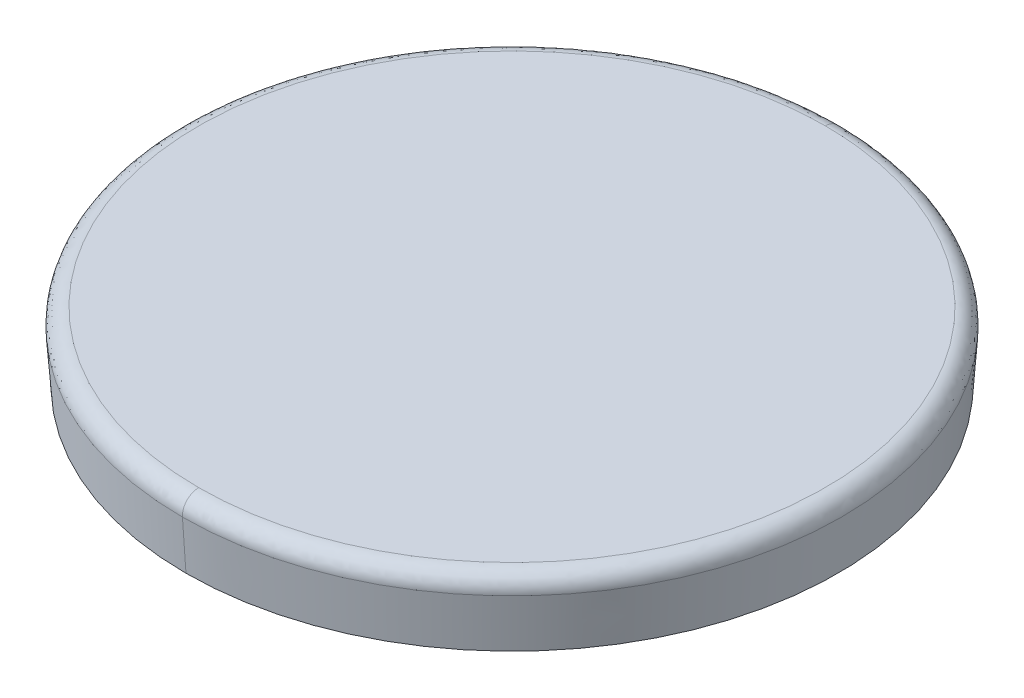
ISO-10303-21;
HEADER;
FILE_DESCRIPTION(('STEP AP214'),'2;1');
FILE_NAME('part.step','',(''),(''),'','','');
FILE_SCHEMA(('AUTOMOTIVE_DESIGN { 1 0 10303 214 1 1 1 1 }'));
ENDSEC;
DATA;
#1=APPLICATION_CONTEXT('core data for automotive mechanical design processes');
#2=APPLICATION_PROTOCOL_DEFINITION('international standard','automotive_design',2000,#1);
#3=PRODUCT_CONTEXT('',#1,'mechanical');
#4=PRODUCT('Part','Part','',(#3));
#5=PRODUCT_RELATED_PRODUCT_CATEGORY('part','',(#4));
#6=PRODUCT_DEFINITION_FORMATION('','',#4);
#7=PRODUCT_DEFINITION_CONTEXT('part definition',#1,'design');
#8=PRODUCT_DEFINITION('design','',#6,#7);
#9=PRODUCT_DEFINITION_SHAPE('','',#8);
#10=(LENGTH_UNIT() NAMED_UNIT(*) SI_UNIT(.MILLI.,.METRE.));
#11=(NAMED_UNIT(*) PLANE_ANGLE_UNIT() SI_UNIT($,.RADIAN.));
#12=(NAMED_UNIT(*) SI_UNIT($,.STERADIAN.) SOLID_ANGLE_UNIT());
#13=UNCERTAINTY_MEASURE_WITH_UNIT(LENGTH_MEASURE(1.E-05),#10,'distance_accuracy_value','');
#14=(GEOMETRIC_REPRESENTATION_CONTEXT(3) GLOBAL_UNCERTAINTY_ASSIGNED_CONTEXT((#13)) GLOBAL_UNIT_ASSIGNED_CONTEXT((#10,
#11,#12)) REPRESENTATION_CONTEXT('',''));
#15=CARTESIAN_POINT('',(0.,0.,0.));
#16=DIRECTION('',(0.,0.,1.));
#17=DIRECTION('',(1.,0.,0.));
#18=AXIS2_PLACEMENT_3D('',#15,#16,#17);
#19=CARTESIAN_POINT('',(32.,13.2498463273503,7.06539894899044));
#20=CARTESIAN_POINT('',(43.5307978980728,13.2498463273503,7.06539894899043));
#21=CARTESIAN_POINT('',(43.5307978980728,13.2498463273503,-4.46539894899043));
#22=CARTESIAN_POINT('',(32.,13.2498463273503,-4.46539894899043));
#23=CARTESIAN_POINT('',(32.,13.2560836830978,7.26019516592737));
#24=CARTESIAN_POINT('',(43.9203903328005,13.2560836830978,7.26019516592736));
#25=CARTESIAN_POINT('',(43.9203903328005,13.2560836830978,-4.66019516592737));
#26=CARTESIAN_POINT('',(32.,13.2560836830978,-4.66019516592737));
#27=CARTESIAN_POINT('',(32.,13.113584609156,7.39317039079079));
#28=CARTESIAN_POINT('',(44.1863407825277,13.113584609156,7.3931703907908));
#29=CARTESIAN_POINT('',(44.1863407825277,13.113584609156,-4.79317039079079));
#30=CARTESIAN_POINT('',(32.,13.113584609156,-4.79317039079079));
#31=CARTESIAN_POINT('',(32.,12.91966729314,7.37346260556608));
#32=CARTESIAN_POINT('',(44.1469252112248,12.9196672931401,7.3734626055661));
#33=CARTESIAN_POINT('',(44.1469252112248,12.9196672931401,-4.77346260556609));
#34=CARTESIAN_POINT('',(32.,12.91966729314,-4.77346260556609));
#35=(BOUNDED_SURFACE() B_SPLINE_SURFACE(3,3,((#19,#20,#21,#22),(#23,#24,#25,#26),(#27,#28,#29,
#30),(#31,#32,#33,#34)),.UNSPECIFIED.,.F.,.F.,.F.) B_SPLINE_SURFACE_WITH_KNOTS((4,4),(4,4),
(0.0420276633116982,0.957651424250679),(0.,1.),
.UNSPECIFIED.) GEOMETRIC_REPRESENTATION_ITEM() RATIONAL_B_SPLINE_SURFACE(((0.968240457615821,
0.322746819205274,0.322746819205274,0.968240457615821),(0.747718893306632,0.249239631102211,
0.249239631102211,0.747718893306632),(0.74764163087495,0.249213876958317,0.249213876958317,
0.74764163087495),(0.968008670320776,0.322669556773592,0.322669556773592,0.968008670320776))) REPRESENTATION_ITEM('') SURFACE());
#36=CARTESIAN_POINT('',(32.,12.9290767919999,1.3));
#37=DIRECTION('',(0.,1.,0.));
#38=DIRECTION('',(0.,0.,1.));
#39=AXIS2_PLACEMENT_3D('',#36,#37,#38);
#40=CIRCLE('',#39,6.074269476);
#41=CARTESIAN_POINT('',(32.,12.9290767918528,7.37426947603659));
#42=VERTEX_POINT('',#41);
#43=CARTESIAN_POINT('',(31.9999999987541,12.9290767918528,-4.77426947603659));
#44=VERTEX_POINT('',#43);
#45=EDGE_CURVE('E82',#42,#44,#40,.T.);
#46=CARTESIAN_POINT('',(31.9999999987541,12.9290767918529,-4.77426947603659));
#47=CARTESIAN_POINT('',(32.,13.1142460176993,-4.78721544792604));
#48=CARTESIAN_POINT('',(32.,13.2499999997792,-4.6606212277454));
#49=CARTESIAN_POINT('',(32.,13.2500000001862,-4.47499999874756));
#50=(BOUNDED_CURVE() B_SPLINE_CURVE(3,(#46,#47,#48,#49),.UNSPECIFIED.,.F.,
.F.) B_SPLINE_CURVE_WITH_KNOTS((4,4),(0.061361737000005,0.938638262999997),
.UNSPECIFIED.) CURVE() GEOMETRIC_REPRESENTATION_ITEM() RATIONAL_B_SPLINE_CURVE((0.954565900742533,
0.752199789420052,0.752199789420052,0.954565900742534)) REPRESENTATION_ITEM(''));
#51=CARTESIAN_POINT('',(32.,13.2500000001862,-4.47499999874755));
#52=VERTEX_POINT('',#51);
#53=EDGE_CURVE('E103',#44,#52,#50,.T.);
#54=CARTESIAN_POINT('',(32.,13.2500000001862,7.07499999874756));
#55=CARTESIAN_POINT('',(32.1282479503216,13.25,7.07499999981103));
#56=CARTESIAN_POINT('',(32.320258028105,13.25,7.06861172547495));
#57=CARTESIAN_POINT('',(32.5436365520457,13.25,7.0499792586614));
#58=CARTESIAN_POINT('',(32.6551675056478,13.25,7.0378681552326));
#59=CARTESIAN_POINT('',(32.7029325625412,13.25,7.03207878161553));
#60=CARTESIAN_POINT('',(32.7347683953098,13.25,7.02808611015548));
#61=CARTESIAN_POINT('',(32.7486141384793,13.25,7.02630006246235));
#62=CARTESIAN_POINT('',(32.9104231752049,13.25,7.00464374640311));
#63=CARTESIAN_POINT('',(33.1245967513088,13.25,6.96771947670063));
#64=CARTESIAN_POINT('',(33.3717152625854,13.25,6.91055509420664));
#65=CARTESIAN_POINT('',(33.4945868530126,13.25,6.87845138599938));
#66=CARTESIAN_POINT('',(33.5558507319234,13.25,6.86151915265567));
#67=CARTESIAN_POINT('',(33.5820698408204,13.25,6.85407382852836));
#68=CARTESIAN_POINT('',(33.599541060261,13.25,6.84906835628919));
#69=CARTESIAN_POINT('',(33.607180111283,13.25,6.84686318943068));
#70=CARTESIAN_POINT('',(33.7741182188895,13.25,6.79818896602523));
#71=CARTESIAN_POINT('',(34.0061591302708,13.25,6.71970709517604));
#72=CARTESIAN_POINT('',(34.2705097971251,13.25,6.61105560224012));
#73=CARTESIAN_POINT('',(34.4010941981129,13.25,6.55245752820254));
#74=CARTESIAN_POINT('',(34.465988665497,13.25,6.52209040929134));
#75=CARTESIAN_POINT('',(34.4937153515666,13.25,6.50884705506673));
#76=CARTESIAN_POINT('',(34.5121808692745,13.25,6.49996729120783));
#77=CARTESIAN_POINT('',(34.520327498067,13.25,6.49602673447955));
#78=CARTESIAN_POINT('',(34.6952656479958,13.25,6.4107632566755));
#79=CARTESIAN_POINT('',(34.9355491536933,13.25,6.27920086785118));
#80=CARTESIAN_POINT('',(35.2041759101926,13.25,6.1061281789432));
#81=CARTESIAN_POINT('',(35.3355632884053,13.25,6.01469602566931));
#82=CARTESIAN_POINT('',(35.4005254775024,13.25,5.96775599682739));
#83=CARTESIAN_POINT('',(35.4282096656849,13.25,5.94737656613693));
#84=CARTESIAN_POINT('',(35.4466309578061,13.25,5.93373199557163));
#85=CARTESIAN_POINT('',(35.4548764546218,13.25,5.92759123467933));
#86=CARTESIAN_POINT('',(35.6269767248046,13.25,5.79854024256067));
#87=CARTESIAN_POINT('',(35.8592126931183,13.25,5.6046029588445));
#88=CARTESIAN_POINT('',(36.1113786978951,13.25,5.35778441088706));
#89=CARTESIAN_POINT('',(36.2327677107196,13.25,5.22923554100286));
#90=CARTESIAN_POINT('',(36.2837857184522,13.25,5.1730418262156));
#91=CARTESIAN_POINT('',(36.3175742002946,13.25,5.1353346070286));
#92=CARTESIAN_POINT('',(36.3329576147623,13.25,5.11796142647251));
#93=CARTESIAN_POINT('',(36.4955856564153,13.25,4.93165105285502));
#94=CARTESIAN_POINT('',(36.697074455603,13.25,4.67249248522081));
#95=CARTESIAN_POINT('',(36.9052846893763,13.25,4.35133753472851));
#96=CARTESIAN_POINT('',(37.0026747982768,13.25,4.18605923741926));
#97=CARTESIAN_POINT('',(37.0429744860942,13.25,4.11421836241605));
#98=CARTESIAN_POINT('',(37.069521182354,13.25,4.06610059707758));
#99=CARTESIAN_POINT('',(37.0818708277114,13.25,4.04336164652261));
#100=CARTESIAN_POINT('',(37.2053274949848,13.25,3.81193035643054));
#101=CARTESIAN_POINT('',(37.350346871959,13.25,3.49562925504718));
#102=CARTESIAN_POINT('',(37.4852544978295,13.25,3.11309071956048));
#103=CARTESIAN_POINT('',(37.5357259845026,13.25,2.94624836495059));
#104=CARTESIAN_POINT('',(37.5677411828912,13.25,2.83437629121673));
#105=CARTESIAN_POINT('',(37.5825057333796,13.25,2.77979827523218));
#106=CARTESIAN_POINT('',(37.7157233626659,13.25,2.25545995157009));
#107=CARTESIAN_POINT('',(37.7749542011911,13.25,1.78088619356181));
#108=CARTESIAN_POINT('',(37.7750228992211,13.25,1.05955690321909));
#109=CARTESIAN_POINT('',(37.7528285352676,13.25,0.701532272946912));
#110=CARTESIAN_POINT('',(37.68803486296,13.25,0.288456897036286));
#111=CARTESIAN_POINT('',(37.6519303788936,13.25,0.112414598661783));
#112=CARTESIAN_POINT('',(37.6260083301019,13.25,-0.00472693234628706));
#113=CARTESIAN_POINT('',(37.6116505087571,13.25,-0.0650414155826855));
#114=CARTESIAN_POINT('',(37.5399364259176,13.25,-0.347526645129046));
#115=CARTESIAN_POINT('',(37.4341930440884,13.25,-0.679031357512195));
#116=CARTESIAN_POINT('',(37.27637442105,13.25,-1.05270111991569));
#117=CARTESIAN_POINT('',(37.1888522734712,13.25,-1.23626456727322));
#118=CARTESIAN_POINT('',(37.1494971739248,13.25,-1.31423359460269));
#119=CARTESIAN_POINT('',(37.1228503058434,13.25,-1.36605716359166));
#120=CARTESIAN_POINT('',(37.1085170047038,13.25,-1.39340038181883));
#121=CARTESIAN_POINT('',(36.9921580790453,13.25,-1.61162047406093));
#122=CARTESIAN_POINT('',(36.8215153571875,13.25,-1.89205218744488));
#123=CARTESIAN_POINT('',(36.595311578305,13.25,-2.2007978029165));
#124=CARTESIAN_POINT('',(36.4754295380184,13.25,-2.3505644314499));
#125=CARTESIAN_POINT('',(36.4225986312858,13.25,-2.41376309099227));
#126=CARTESIAN_POINT('',(36.3870551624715,13.25,-2.4556761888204));
#127=CARTESIAN_POINT('',(36.3676659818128,13.25,-2.47819172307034));
#128=CARTESIAN_POINT('',(36.2179187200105,13.25,-2.6498086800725));
#129=CARTESIAN_POINT('',(36.0073337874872,13.25,-2.86706245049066));
#130=CARTESIAN_POINT('',(35.7425380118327,13.25,-3.10027971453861));
#131=CARTESIAN_POINT('',(35.6053617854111,13.25,-3.21182697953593));
#132=CARTESIAN_POINT('',(35.5355790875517,13.25,-3.26633527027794));
#133=CARTESIAN_POINT('',(35.5054162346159,13.25,-3.28942482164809));
#134=CARTESIAN_POINT('',(35.4852507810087,13.25,-3.30475760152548));
#135=CARTESIAN_POINT('',(35.4741575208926,13.25,-3.3131305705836));
#136=CARTESIAN_POINT('',(35.31847966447,13.25,-3.42991086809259));
#137=CARTESIAN_POINT('',(35.0917916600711,13.25,-3.58372042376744));
#138=CARTESIAN_POINT('',(34.815234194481,13.25,-3.74381559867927));
#139=CARTESIAN_POINT('',(34.6739334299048,13.25,-3.81902585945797));
#140=CARTESIAN_POINT('',(34.6025275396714,13.25,-3.85542165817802));
#141=CARTESIAN_POINT('',(34.5717631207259,13.25,-3.87076071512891));
#142=CARTESIAN_POINT('',(34.5512175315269,13.25,-3.88092916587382));
#143=CARTESIAN_POINT('',(34.5398119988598,13.25,-3.88652815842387));
#144=CARTESIAN_POINT('',(34.38351363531,13.25,-3.96274047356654));
#145=CARTESIAN_POINT('',(34.1589831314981,13.25,-4.06066099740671));
#146=CARTESIAN_POINT('',(33.8902513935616,13.25,-4.15797327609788));
#147=CARTESIAN_POINT('',(33.7541906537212,13.25,-4.20239733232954));
#148=CARTESIAN_POINT('',(33.6857365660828,13.25,-4.2235513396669));
#149=CARTESIAN_POINT('',(33.6563083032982,13.25,-4.23239062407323));
#150=CARTESIAN_POINT('',(33.6366692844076,13.25,-4.23823309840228));
#151=CARTESIAN_POINT('',(33.6257065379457,13.25,-4.24145975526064));
#152=CARTESIAN_POINT('',(33.4776953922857,13.25,-4.28464391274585));
#153=CARTESIAN_POINT('',(33.2669160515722,13.25,-4.33761357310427));
#154=CARTESIAN_POINT('',(33.0178175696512,13.25,-4.38541814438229));
#155=CARTESIAN_POINT('',(32.8924710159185,13.25,-4.4058220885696));
#156=CARTESIAN_POINT('',(32.8385802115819,13.25,-4.41381699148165));
#157=CARTESIAN_POINT('',(32.8026150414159,13.25,-4.41898033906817));
#158=CARTESIAN_POINT('',(32.782481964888,13.25,-4.42176438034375));
#159=CARTESIAN_POINT('',(32.5123682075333,13.25,-4.4579646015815));
#160=CARTESIAN_POINT('',(32.2568372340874,13.25,-4.47499999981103));
#161=CARTESIAN_POINT('',(32.,13.2500000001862,-4.47499999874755));
#162=(BOUNDED_CURVE() B_SPLINE_CURVE(3,(#54,#55,#56,#57,#58,#59,#60,#61,#62,#63,#64,#65,#66,#67,
#68,#69,#70,#71,#72,#73,#74,#75,#76,#77,#78,#79,#80,#81,#82,#83,#84,#85,#86,#87,#88,#89,#90,#91,
#92,#93,#94,#95,#96,#97,#98,#99,#100,#101,#102,#103,#104,#105,#106,#107,#108,#109,#110,#111,
#112,#113,#114,#115,#116,#117,#118,#119,#120,#121,#122,#123,#124,#125,#126,#127,#128,#129,#130,
#131,#132,#133,#134,#135,#136,#137,#138,#139,#140,#141,#142,#143,#144,#145,#146,#147,#148,#149,
#150,#151,#152,#153,#154,#155,#156,#157,#158,#159,#160,#161),.UNSPECIFIED.,.F.,
.F.) B_SPLINE_CURVE_WITH_KNOTS((4,1,1,1,2,2,1,1,1,1,2,2,1,1,1,1,2,2,1,1,1,1,2,2,1,1,1,2,2,1,1,1,
2,2,1,1,2,2,2,1,1,2,2,1,1,1,2,2,1,1,1,2,2,1,1,1,1,2,2,1,1,1,1,2,2,1,1,1,1,2,2,1,1,1,2,2,4),(0.,
0.0312500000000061,0.0468750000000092,0.0546875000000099,0.0585937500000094,0.0625000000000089,
0.0937500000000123,0.109375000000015,0.117187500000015,0.121093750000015,0.123046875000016,
0.125000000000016,0.156250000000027,0.171875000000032,0.179687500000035,0.183593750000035,
0.185546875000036,0.187500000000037,0.218750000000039,0.23437500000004,0.24218750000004,
0.24609375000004,0.24804687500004,0.250000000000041,0.281250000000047,0.296875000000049,
0.304687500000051,0.308593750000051,0.312500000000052,0.343750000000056,0.359375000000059,
0.36718750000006,0.371093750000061,0.375000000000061,0.406250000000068,0.421875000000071,
0.429687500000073,0.437500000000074,0.5,0.531250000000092,0.546875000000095,0.554687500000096,
0.562500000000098,0.593750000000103,0.609375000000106,0.617187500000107,0.621093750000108,
0.625000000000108,0.656250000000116,0.671875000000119,0.679687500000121,0.683593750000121,
0.687500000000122,0.718750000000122,0.734375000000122,0.742187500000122,0.746093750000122,
0.748046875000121,0.750000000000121,0.781250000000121,0.79687500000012,0.80468750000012,
0.808593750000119,0.810546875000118,0.812500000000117,0.843750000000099,0.859375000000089,
0.867187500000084,0.871093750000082,0.873046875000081,0.87500000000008,0.906250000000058,
0.921875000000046,0.929687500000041,0.933593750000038,0.937500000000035,1.),
.UNSPECIFIED.) CURVE() GEOMETRIC_REPRESENTATION_ITEM() RATIONAL_B_SPLINE_CURVE((1.,1.,1.,1.,1.,
1.,1.,1.,1.,1.,1.,1.,1.,1.,1.,1.,1.,1.,1.,1.,1.,1.,1.,1.,1.,1.,1.,1.,1.,1.,1.,1.,1.,1.,1.,1.,1.,
1.,1.,1.,1.,1.,1.,1.,1.,1.,1.,1.,1.,1.,1.,1.,1.,1.,1.,1.,1.,1.,1.,1.,1.,1.,1.,1.,1.,1.,1.,1.,1.,
1.,1.,1.,1.,1.,1.,1.,1.,1.,1.,1.,1.,1.,1.,1.,1.,1.,1.,1.,1.,1.,1.,1.,1.,1.,1.,1.,1.,1.,1.,1.,1.,
1.,1.,1.,1.,1.,1.,1.)) REPRESENTATION_ITEM(''));
#163=CARTESIAN_POINT('',(32.,13.2500000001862,7.07499999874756));
#164=VERTEX_POINT('',#163);
#165=EDGE_CURVE('E11',#164,#52,#162,.T.);
#166=CARTESIAN_POINT('',(32.,13.2500000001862,7.07499999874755));
#167=CARTESIAN_POINT('',(32.,13.2499999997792,7.2606212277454));
#168=CARTESIAN_POINT('',(32.,13.1142460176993,7.38721544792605));
#169=CARTESIAN_POINT('',(32.,12.9290767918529,7.3742694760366));
#170=(BOUNDED_CURVE() B_SPLINE_CURVE(3,(#166,#167,#168,#169),.UNSPECIFIED.,.F.,
.F.) B_SPLINE_CURVE_WITH_KNOTS((4,4),(0.0613617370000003,0.938638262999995),
.UNSPECIFIED.) CURVE() GEOMETRIC_REPRESENTATION_ITEM() RATIONAL_B_SPLINE_CURVE((0.954565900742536,
0.752199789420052,0.752199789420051,0.954565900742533)) REPRESENTATION_ITEM(''));
#171=EDGE_CURVE('E96',#164,#42,#170,.T.);
#172=ORIENTED_EDGE('',*,*,#45,.T.);
#173=ORIENTED_EDGE('',*,*,#53,.T.);
#174=ORIENTED_EDGE('',*,*,#165,.F.);
#175=ORIENTED_EDGE('',*,*,#171,.T.);
#176=EDGE_LOOP('',(#172,#173,#174,#175));
#177=FACE_BOUND('',#176,.T.);
#178=ADVANCED_FACE('F16',(#177),#35,.T.);
#179=CARTESIAN_POINT('',(26.1557,13.25,-4.5443));
#180=DIRECTION('',(0.,1.,0.));
#181=DIRECTION('',(1.,0.,0.));
#182=AXIS2_PLACEMENT_3D('',#179,#180,#181);
#183=PLANE('',#182);
#184=ORIENTED_EDGE('',*,*,#165,.T.);
#185=CARTESIAN_POINT('',(32.,13.2500000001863,7.07499999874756));
#186=CARTESIAN_POINT('',(20.4500000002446,13.2500000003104,7.07499999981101));
#187=CARTESIAN_POINT('',(20.4500000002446,13.2500000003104,-4.47499999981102));
#188=CARTESIAN_POINT('',(32.,13.2500000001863,-4.47499999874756));
#189=(BOUNDED_CURVE() B_SPLINE_CURVE(3,(#185,#186,#187,#188),.UNSPECIFIED.,.F.,
.F.) B_SPLINE_CURVE_WITH_KNOTS((4,4),(0.,1.),
.UNSPECIFIED.) CURVE() GEOMETRIC_REPRESENTATION_ITEM() RATIONAL_B_SPLINE_CURVE((0.954565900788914,
0.318188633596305,0.318188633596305,0.954565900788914)) REPRESENTATION_ITEM(''));
#190=EDGE_CURVE('E28',#164,#52,#189,.T.);
#191=ORIENTED_EDGE('',*,*,#190,.F.);
#192=EDGE_LOOP('',(#184,#191));
#193=FACE_BOUND('',#192,.T.);
#194=ADVANCED_FACE('F120',(#193),#183,.T.);
#195=CARTESIAN_POINT('',(25.918574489,12.,7.381425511));
#196=DIRECTION('',(0.,-1.,0.));
#197=DIRECTION('',(0.,0.,-1.));
#198=AXIS2_PLACEMENT_3D('',#195,#196,#197);
#199=PLANE('',#198);
#200=CARTESIAN_POINT('',(32.,12.,1.3));
#201=DIRECTION('',(0.,-1.,0.));
#202=DIRECTION('',(0.,0.,1.));
#203=AXIS2_PLACEMENT_3D('',#200,#201,#202);
#204=CIRCLE('',#203,6.00931374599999);
#205=CARTESIAN_POINT('',(32.,12.,7.30931374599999));
#206=VERTEX_POINT('',#205);
#207=CARTESIAN_POINT('',(32.,12.,-4.70931374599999));
#208=VERTEX_POINT('',#207);
#209=EDGE_CURVE('E61',#206,#208,#204,.T.);
#210=ORIENTED_EDGE('',*,*,#209,.T.);
#211=CARTESIAN_POINT('',(32.,12.,1.3));
#212=DIRECTION('',(0.,-1.,0.));
#213=DIRECTION('',(0.,0.,1.));
#214=AXIS2_PLACEMENT_3D('',#211,#212,#213);
#215=CIRCLE('',#214,6.00931374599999);
#216=EDGE_CURVE('E65',#208,#206,#215,.T.);
#217=ORIENTED_EDGE('',*,*,#216,.T.);
#218=EDGE_LOOP('',(#210,#217));
#219=FACE_BOUND('',#218,.T.);
#220=ADVANCED_FACE('F63',(#219),#199,.T.);
#221=CARTESIAN_POINT('',(32.,13.2499988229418,-4.47415951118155));
#222=CARTESIAN_POINT('',(20.4516809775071,13.2499988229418,-4.47415951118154));
#223=CARTESIAN_POINT('',(20.4516809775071,13.2499988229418,7.07415951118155));
#224=CARTESIAN_POINT('',(32.,13.2499988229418,7.07415951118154));
#225=CARTESIAN_POINT('',(32.,13.2505342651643,-4.66527714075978));
#226=CARTESIAN_POINT('',(20.0694457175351,13.2505342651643,-4.66527714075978));
#227=CARTESIAN_POINT('',(20.0694457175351,13.2505342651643,7.26527714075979));
#228=CARTESIAN_POINT('',(32.,13.2505342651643,7.26527714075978));
#229=CARTESIAN_POINT('',(32.,13.1087713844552,-4.79268122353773));
#230=CARTESIAN_POINT('',(19.8146375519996,13.1087713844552,-4.79268122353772));
#231=CARTESIAN_POINT('',(19.8146375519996,13.1087713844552,7.39268122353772));
#232=CARTESIAN_POINT('',(32.,13.1087713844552,7.39268122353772));
#233=CARTESIAN_POINT('',(32.,12.9196672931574,-4.77346260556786));
#234=CARTESIAN_POINT('',(19.8530747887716,12.9196672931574,-4.77346260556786));
#235=CARTESIAN_POINT('',(19.8530747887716,12.9196672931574,7.37346260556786));
#236=CARTESIAN_POINT('',(32.,12.9196672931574,7.37346260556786));
#237=(BOUNDED_SURFACE() B_SPLINE_SURFACE(3,3,((#221,#222,#223,#224),(#225,#226,#227,#228),(#229,
#230,#231,#232),(#233,#234,#235,#236)),.UNSPECIFIED.,.F.,.F.,
.F.) B_SPLINE_SURFACE_WITH_KNOTS((4,4),(4,4),(0.0596803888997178,0.957651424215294),(0.,1.),
.UNSPECIFIED.) GEOMETRIC_REPRESENTATION_ITEM() RATIONAL_B_SPLINE_SURFACE(((0.955731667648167,
0.318577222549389,0.318577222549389,0.955731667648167),(0.747797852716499,0.2492659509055,
0.2492659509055,0.747797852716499),(0.751890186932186,0.250630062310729,0.250630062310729,
0.751890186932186),(0.968008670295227,0.322669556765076,0.322669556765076,0.968008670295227))) REPRESENTATION_ITEM('') SURFACE());
#238=CARTESIAN_POINT('',(32.,12.9290767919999,1.3));
#239=DIRECTION('',(0.,1.,0.));
#240=DIRECTION('',(0.,0.,1.));
#241=AXIS2_PLACEMENT_3D('',#238,#239,#240);
#242=CIRCLE('',#241,6.074269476);
#243=EDGE_CURVE('E70',#44,#42,#242,.T.);
#244=ORIENTED_EDGE('',*,*,#53,.F.);
#245=ORIENTED_EDGE('',*,*,#243,.T.);
#246=ORIENTED_EDGE('',*,*,#171,.F.);
#247=ORIENTED_EDGE('',*,*,#190,.T.);
#248=EDGE_LOOP('',(#244,#245,#246,#247));
#249=FACE_BOUND('',#248,.T.);
#250=ADVANCED_FACE('F119',(#249),#237,.T.);
#251=CARTESIAN_POINT('',(32.,12.,1.3));
#252=DIRECTION('',(0.,1.,0.));
#253=DIRECTION('',(0.,0.,1.));
#254=AXIS2_PLACEMENT_3D('',#251,#252,#253);
#255=CONICAL_SURFACE('',#254,6.009313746,0.0698006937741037);
#256=DIRECTION('',(0.,0.997564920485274,-0.0697440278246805));
#257=VECTOR('',#256,1.);
#258=CARTESIAN_POINT('',(32.,12.,-4.709313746));
#259=LINE('',#258,#257);
#260=EDGE_CURVE('E75',#208,#44,#259,.T.);
#261=ORIENTED_EDGE('',*,*,#260,.F.);
#262=ORIENTED_EDGE('',*,*,#209,.F.);
#263=DIRECTION('',(0.,0.997564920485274,0.0697440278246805));
#264=VECTOR('',#263,1.);
#265=CARTESIAN_POINT('',(32.,12.,7.309313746));
#266=LINE('',#265,#264);
#267=EDGE_CURVE('E71',#206,#42,#266,.T.);
#268=ORIENTED_EDGE('',*,*,#267,.T.);
#269=ORIENTED_EDGE('',*,*,#243,.F.);
#270=EDGE_LOOP('',(#261,#262,#268,#269));
#271=FACE_BOUND('',#270,.T.);
#272=ADVANCED_FACE('F76',(#271),#255,.T.);
#273=CARTESIAN_POINT('',(32.,12.,1.3));
#274=DIRECTION('',(0.,1.,0.));
#275=DIRECTION('',(0.,0.,1.));
#276=AXIS2_PLACEMENT_3D('',#273,#274,#275);
#277=CONICAL_SURFACE('',#276,6.009313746,0.0698006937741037);
#278=ORIENTED_EDGE('',*,*,#216,.F.);
#279=ORIENTED_EDGE('',*,*,#260,.T.);
#280=ORIENTED_EDGE('',*,*,#45,.F.);
#281=ORIENTED_EDGE('',*,*,#267,.F.);
#282=EDGE_LOOP('',(#278,#279,#280,#281));
#283=FACE_BOUND('',#282,.T.);
#284=ADVANCED_FACE('F84',(#283),#277,.T.);
#285=CLOSED_SHELL('',(#178,#194,#220,#250,#272,#284));
#286=MANIFOLD_SOLID_BREP('B1',#285);
#287=ADVANCED_BREP_SHAPE_REPRESENTATION('',(#18,#286),#14);
#288=SHAPE_DEFINITION_REPRESENTATION(#9,#287);
ENDSEC;
END-ISO-10303-21;
